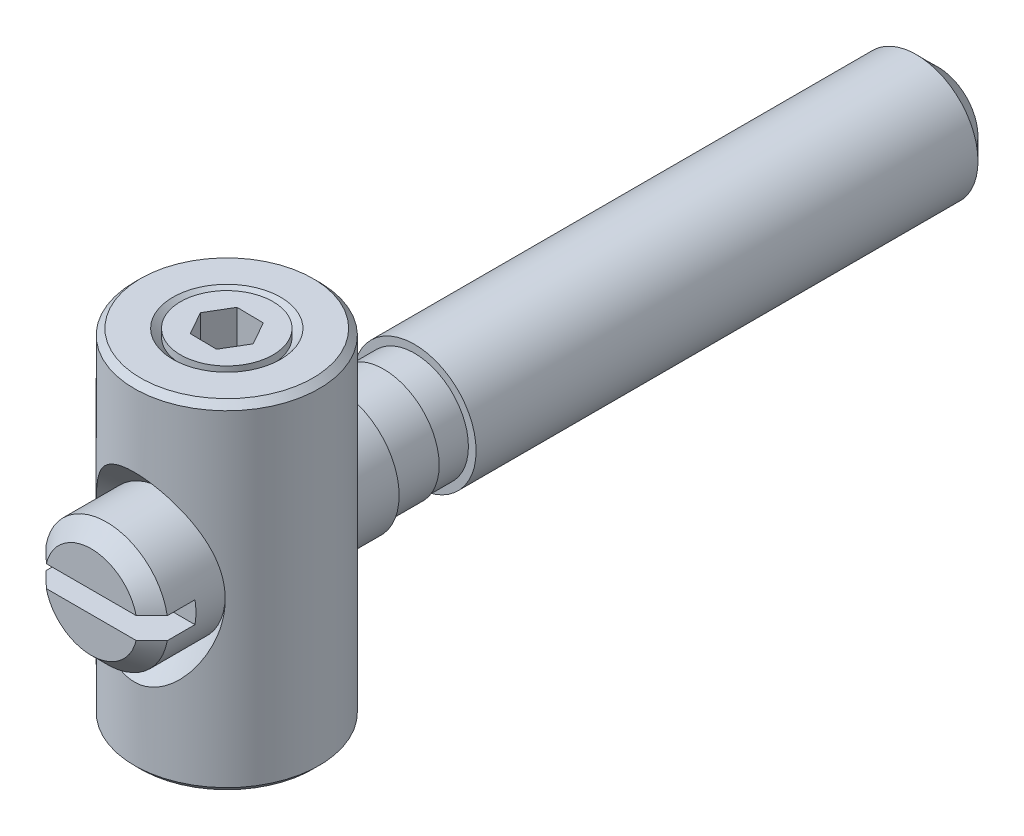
ISO-10303-21;
HEADER;
FILE_DESCRIPTION(('STEP AP214'),'2;1');
FILE_NAME('part.step','',(''),(''),'','','');
FILE_SCHEMA(('AUTOMOTIVE_DESIGN { 1 0 10303 214 1 1 1 1 }'));
ENDSEC;
DATA;
#1=APPLICATION_CONTEXT('core data for automotive mechanical design processes');
#2=APPLICATION_PROTOCOL_DEFINITION('international standard','automotive_design',2000,#1);
#3=PRODUCT_CONTEXT('',#1,'mechanical');
#4=PRODUCT('Part','Part','',(#3));
#5=PRODUCT_RELATED_PRODUCT_CATEGORY('part','',(#4));
#6=PRODUCT_DEFINITION_FORMATION('','',#4);
#7=PRODUCT_DEFINITION_CONTEXT('part definition',#1,'design');
#8=PRODUCT_DEFINITION('design','',#6,#7);
#9=PRODUCT_DEFINITION_SHAPE('','',#8);
#10=(LENGTH_UNIT() NAMED_UNIT(*) SI_UNIT(.MILLI.,.METRE.));
#11=(NAMED_UNIT(*) PLANE_ANGLE_UNIT() SI_UNIT($,.RADIAN.));
#12=(NAMED_UNIT(*) SI_UNIT($,.STERADIAN.) SOLID_ANGLE_UNIT());
#13=UNCERTAINTY_MEASURE_WITH_UNIT(LENGTH_MEASURE(1.E-05),#10,'distance_accuracy_value','');
#14=(GEOMETRIC_REPRESENTATION_CONTEXT(3) GLOBAL_UNCERTAINTY_ASSIGNED_CONTEXT((#13)) GLOBAL_UNIT_ASSIGNED_CONTEXT((#10,
#11,#12)) REPRESENTATION_CONTEXT('',''));
#15=CARTESIAN_POINT('',(0.,0.,0.));
#16=DIRECTION('',(0.,0.,1.));
#17=DIRECTION('',(1.,0.,0.));
#18=AXIS2_PLACEMENT_3D('',#15,#16,#17);
#19=CARTESIAN_POINT('',(0.,0.,34.697365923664));
#20=DIRECTION('',(0.,0.,1.));
#21=DIRECTION('',(1.,0.,0.));
#22=AXIS2_PLACEMENT_3D('',#19,#20,#21);
#23=CYLINDRICAL_SURFACE('',#22,2.);
#24=CARTESIAN_POINT('',(0.,0.,-22.398));
#25=DIRECTION('',(0.,0.,-1.));
#26=DIRECTION('',(0.,-1.,0.));
#27=AXIS2_PLACEMENT_3D('',#24,#25,#26);
#28=CIRCLE('',#27,2.);
#29=CARTESIAN_POINT('',(0.,-2.,-22.398));
#30=VERTEX_POINT('',#29);
#31=EDGE_CURVE('E9',#30,#30,#28,.F.);
#32=ORIENTED_EDGE('',*,*,#31,.T.);
#33=EDGE_LOOP('',(#32));
#34=FACE_BOUND('',#33,.T.);
#35=CARTESIAN_POINT('',(0.,0.,-6.098));
#36=DIRECTION('',(0.,0.,1.));
#37=DIRECTION('',(1.,0.,0.));
#38=AXIS2_PLACEMENT_3D('',#35,#36,#37);
#39=CIRCLE('',#38,2.);
#40=CARTESIAN_POINT('',(2.,0.,-6.098));
#41=VERTEX_POINT('',#40);
#42=EDGE_CURVE('E283',#41,#41,#39,.T.);
#43=ORIENTED_EDGE('',*,*,#42,.F.);
#44=EDGE_LOOP('',(#43));
#45=FACE_BOUND('',#44,.T.);
#46=ADVANCED_FACE('F14',(#34,#45),#23,.T.);
#47=CARTESIAN_POINT('',(0.,0.,4.402));
#48=DIRECTION('',(0.,0.,-1.));
#49=DIRECTION('',(-1.,0.,0.));
#50=AXIS2_PLACEMENT_3D('',#47,#48,#49);
#51=PLANE('',#50);
#52=CARTESIAN_POINT('',(0.,0.,4.402));
#53=DIRECTION('',(0.,0.,-1.));
#54=DIRECTION('',(-1.,0.,0.));
#55=AXIS2_PLACEMENT_3D('',#52,#53,#54);
#56=CIRCLE('',#55,1.5);
#57=CARTESIAN_POINT('',(1.45859521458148,0.35,4.402));
#58=VERTEX_POINT('',#57);
#59=CARTESIAN_POINT('',(-1.45859521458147,0.35,4.402));
#60=VERTEX_POINT('',#59);
#61=EDGE_CURVE('E286',#58,#60,#56,.F.);
#62=ORIENTED_EDGE('',*,*,#61,.T.);
#63=DIRECTION('',(-1.,0.,0.));
#64=VECTOR('',#63,1.);
#65=CARTESIAN_POINT('',(-1.96913686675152,0.35,4.402));
#66=LINE('',#65,#64);
#67=EDGE_CURVE('E31',#58,#60,#66,.T.);
#68=ORIENTED_EDGE('',*,*,#67,.F.);
#69=EDGE_LOOP('',(#62,#68));
#70=FACE_BOUND('',#69,.T.);
#71=ADVANCED_FACE('F205',(#70),#51,.F.);
#72=CARTESIAN_POINT('',(-1.45859521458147,-0.35,4.402));
#73=VERTEX_POINT('',#72);
#74=CARTESIAN_POINT('',(1.45859521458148,-0.35,4.402));
#75=VERTEX_POINT('',#74);
#76=EDGE_CURVE('E292',#73,#75,#56,.F.);
#77=ORIENTED_EDGE('',*,*,#76,.T.);
#78=DIRECTION('',(1.,0.,0.));
#79=VECTOR('',#78,1.);
#80=CARTESIAN_POINT('',(-1.96913686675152,-0.35,4.402));
#81=LINE('',#80,#79);
#82=EDGE_CURVE('E324',#73,#75,#81,.T.);
#83=ORIENTED_EDGE('',*,*,#82,.F.);
#84=EDGE_LOOP('',(#77,#83));
#85=FACE_BOUND('',#84,.T.);
#86=ADVANCED_FACE('F212',(#85),#51,.F.);
#87=CARTESIAN_POINT('',(0.,0.,4.402));
#88=DIRECTION('',(0.,0.,-1.));
#89=DIRECTION('',(-1.,0.,0.));
#90=AXIS2_PLACEMENT_3D('',#87,#88,#89);
#91=CONICAL_SURFACE('',#90,1.5,0.785398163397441);
#92=CARTESIAN_POINT('',(4.35126885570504,0.349999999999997,1.53667748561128));
#93=CARTESIAN_POINT('',(4.19641291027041,0.35,1.69103028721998));
#94=CARTESIAN_POINT('',(4.04153476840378,0.350000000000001,1.84536085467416));
#95=CARTESIAN_POINT('',(3.73169612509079,0.350000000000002,2.15395346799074));
#96=CARTESIAN_POINT('',(3.57673562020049,0.350000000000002,2.30821551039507));
#97=CARTESIAN_POINT('',(3.2665365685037,0.350000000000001,2.616803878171));
#98=CARTESIAN_POINT('',(3.11129790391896,0.350000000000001,2.77113008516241));
#99=CARTESIAN_POINT('',(2.80066386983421,0.350000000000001,3.07961097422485));
#100=CARTESIAN_POINT('',(2.64526850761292,0.350000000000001,3.23376566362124));
#101=CARTESIAN_POINT('',(2.34228144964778,0.350000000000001,3.53380176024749));
#102=CARTESIAN_POINT('',(2.19470355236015,0.350000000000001,3.67969710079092));
#103=CARTESIAN_POINT('',(1.89910586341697,0.350000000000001,3.97107818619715));
#104=CARTESIAN_POINT('',(1.75108601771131,0.350000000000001,4.11656387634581));
#105=CARTESIAN_POINT('',(1.52844687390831,0.350000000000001,4.33406929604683));
#106=CARTESIAN_POINT('',(1.45415744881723,0.350000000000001,4.40642627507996));
#107=CARTESIAN_POINT('',(1.30522725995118,0.350000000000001,4.55078536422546));
#108=CARTESIAN_POINT('',(1.23058647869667,0.350000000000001,4.62278745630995));
#109=CARTESIAN_POINT('',(1.08076094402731,0.350000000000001,4.76619144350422));
#110=CARTESIAN_POINT('',(1.00557632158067,0.350000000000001,4.83759347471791));
#111=CARTESIAN_POINT('',(0.892022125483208,0.350000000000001,4.94386077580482));
#112=CARTESIAN_POINT('',(0.85404275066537,0.350000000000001,4.97914249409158));
#113=CARTESIAN_POINT('',(0.777709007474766,0.35,5.04929736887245));
#114=CARTESIAN_POINT('',(0.739354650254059,0.35,5.08417053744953));
#115=CARTESIAN_POINT('',(0.679196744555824,0.35,5.13798633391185));
#116=CARTESIAN_POINT('',(0.65758598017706,0.350000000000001,5.15714426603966));
#117=CARTESIAN_POINT('',(0.614138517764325,0.350000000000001,5.19520729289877));
#118=CARTESIAN_POINT('',(0.592301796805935,0.350000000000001,5.21411236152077));
#119=CARTESIAN_POINT('',(0.548146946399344,0.350000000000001,5.25174589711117));
#120=CARTESIAN_POINT('',(0.525826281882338,0.350000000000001,5.27047139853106));
#121=CARTESIAN_POINT('',(0.480797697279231,0.35,5.3074405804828));
#122=CARTESIAN_POINT('',(0.458089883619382,0.35,5.3256843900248));
#123=CARTESIAN_POINT('',(0.411906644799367,0.35,5.36167156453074));
#124=CARTESIAN_POINT('',(0.388425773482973,0.35,5.37940798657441));
#125=CARTESIAN_POINT('',(0.340709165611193,0.350000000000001,5.41383103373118));
#126=CARTESIAN_POINT('',(0.316473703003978,0.350000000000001,5.43051803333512));
#127=CARTESIAN_POINT('',(0.267118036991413,0.350000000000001,5.46212071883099));
#128=CARTESIAN_POINT('',(0.242006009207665,0.350000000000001,5.47704896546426));
#129=CARTESIAN_POINT('',(0.19037670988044,0.35,5.50417839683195));
#130=CARTESIAN_POINT('',(0.16386395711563,0.35,5.51638775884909));
#131=CARTESIAN_POINT('',(0.115662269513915,0.35,5.53389096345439));
#132=CARTESIAN_POINT('',(0.0943343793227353,0.35,5.54014013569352));
#133=CARTESIAN_POINT('',(0.0509670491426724,0.35,5.54893856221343));
#134=CARTESIAN_POINT('',(0.0289307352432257,0.35,5.55150226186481));
#135=CARTESIAN_POINT('',(-0.0153473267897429,0.35,5.55236596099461));
#136=CARTESIAN_POINT('',(-0.0375895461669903,0.35,5.55064352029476));
#137=CARTESIAN_POINT('',(-0.0814521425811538,0.35,5.54330655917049));
#138=CARTESIAN_POINT('',(-0.103070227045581,0.35,5.53767922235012));
#139=CARTESIAN_POINT('',(-0.146000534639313,0.35,5.52332975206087));
#140=CARTESIAN_POINT('',(-0.167279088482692,0.35,5.51451156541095));
#141=CARTESIAN_POINT('',(-0.208879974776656,0.350000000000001,5.49482143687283));
#142=CARTESIAN_POINT('',(-0.229200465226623,0.35,5.48394572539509));
#143=CARTESIAN_POINT('',(-0.269207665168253,0.35,5.46074603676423));
#144=CARTESIAN_POINT('',(-0.288887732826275,0.35,5.44841081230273));
#145=CARTESIAN_POINT('',(-0.327605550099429,0.35,5.42281699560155));
#146=CARTESIAN_POINT('',(-0.346643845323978,0.35,5.40955921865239));
#147=CARTESIAN_POINT('',(-0.406445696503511,0.35,5.36638652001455));
#148=CARTESIAN_POINT('',(-0.446338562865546,0.35,5.33527476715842));
#149=CARTESIAN_POINT('',(-0.524892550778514,0.350000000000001,5.27152437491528));
#150=CARTESIAN_POINT('',(-0.563552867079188,0.35,5.23888477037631));
#151=CARTESIAN_POINT('',(-0.640169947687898,0.35,5.17265387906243));
#152=CARTESIAN_POINT('',(-0.678125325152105,0.35,5.1390609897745));
#153=CARTESIAN_POINT('',(-0.753518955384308,0.35,5.07132508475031));
#154=CARTESIAN_POINT('',(-0.790957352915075,0.35,5.03718222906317));
#155=CARTESIAN_POINT('',(-0.902510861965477,0.35,4.93443874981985));
#156=CARTESIAN_POINT('',(-0.976123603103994,0.35,4.8652936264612));
#157=CARTESIAN_POINT('',(-1.12257494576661,0.35,4.72634664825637));
#158=CARTESIAN_POINT('',(-1.19541427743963,0.35,4.65654555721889));
#159=CARTESIAN_POINT('',(-1.39829359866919,0.35,4.46099580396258));
#160=CARTESIAN_POINT('',(-1.52788326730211,0.35,4.33478022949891));
#161=CARTESIAN_POINT('',(-1.78647544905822,0.35,4.08174671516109));
#162=CARTESIAN_POINT('',(-1.91547795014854,0.35,3.95492876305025));
#163=CARTESIAN_POINT('',(-2.17321511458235,0.35,3.70088959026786));
#164=CARTESIAN_POINT('',(-2.30194960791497,0.35,3.57366819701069));
#165=CARTESIAN_POINT('',(-2.55921717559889,0.35,3.31902418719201));
#166=CARTESIAN_POINT('',(-2.68775025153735,0.35,3.19160157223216));
#167=CARTESIAN_POINT('',(-3.07247665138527,0.35,2.80981746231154));
#168=CARTESIAN_POINT('',(-3.32848011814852,0.349999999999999,2.55526465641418));
#169=CARTESIAN_POINT('',(-3.71223239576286,0.35,2.17332351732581));
#170=CARTESIAN_POINT('',(-3.84007220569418,0.35,2.04602651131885));
#171=CARTESIAN_POINT('',(-4.09570351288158,0.349999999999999,1.79138474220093));
#172=CARTESIAN_POINT('',(-4.22349501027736,0.349999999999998,1.66403997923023));
#173=CARTESIAN_POINT('',(-4.35126885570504,0.349999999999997,1.53667748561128));
#174=B_SPLINE_CURVE_WITH_KNOTS('',3,(#92,#93,#94,#95,#96,#97,#98,#99,#100,#101,#102,#103,#104,
#105,#106,#107,#108,#109,#110,#111,#112,#113,#114,#115,#116,#117,#118,#119,#120,#121,#122,#123,
#124,#125,#126,#127,#128,#129,#130,#131,#132,#133,#134,#135,#136,#137,#138,#139,#140,#141,#142,
#143,#144,#145,#146,#147,#148,#149,#150,#151,#152,#153,#154,#155,#156,#157,#158,#159,#160,#161,
#162,#163,#164,#165,#166,#167,#168,#169,#170,#171,#172,#173),.UNSPECIFIED.,.F.,.F.,(4,2,2,2,2,2,
2,2,2,2,2,2,2,2,2,2,2,2,2,2,2,2,2,2,2,2,2,2,2,2,2,2,2,2,2,2,2,2,2,2,4),(0.,0.655931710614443,
1.31189343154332,1.96858248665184,2.62524232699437,3.24780305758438,3.87044333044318,
4.18155345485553,4.49267922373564,4.80373240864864,4.95924629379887,5.1147555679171,
5.20139397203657,5.28804125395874,5.37544205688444,5.46281920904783,5.55108162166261,
5.63931235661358,5.72686889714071,5.81415843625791,5.88059131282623,5.94676308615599,
6.0132820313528,6.08002033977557,6.14896231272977,6.21803183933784,6.28767333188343,
6.3572540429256,6.50893272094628,6.66070854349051,6.81275669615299,6.9647613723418,
7.26773191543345,7.57038509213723,8.11307078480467,8.65576754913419,9.19874089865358,
9.74170994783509,10.8247672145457,11.3659953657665,11.9072219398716),.UNSPECIFIED.);
#175=CARTESIAN_POINT('',(1.96913686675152,0.35,3.902));
#176=VERTEX_POINT('',#175);
#177=EDGE_CURVE('E242',#176,#58,#174,.T.);
#178=ORIENTED_EDGE('',*,*,#177,.F.);
#179=CARTESIAN_POINT('',(0.,0.,3.902));
#180=DIRECTION('',(0.,0.,-1.));
#181=DIRECTION('',(-1.,0.,0.));
#182=AXIS2_PLACEMENT_3D('',#179,#180,#181);
#183=CIRCLE('',#182,2.);
#184=CARTESIAN_POINT('',(-1.96913686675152,0.35,3.902));
#185=VERTEX_POINT('',#184);
#186=EDGE_CURVE('E295',#185,#176,#183,.T.);
#187=ORIENTED_EDGE('',*,*,#186,.F.);
#188=EDGE_CURVE('E229',#60,#185,#174,.T.);
#189=ORIENTED_EDGE('',*,*,#188,.F.);
#190=ORIENTED_EDGE('',*,*,#61,.F.);
#191=EDGE_LOOP('',(#178,#187,#189,#190));
#192=FACE_BOUND('',#191,.T.);
#193=ADVANCED_FACE('F220',(#192),#91,.T.);
#194=CARTESIAN_POINT('',(-1.96913686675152,0.35,3.002));
#195=DIRECTION('',(0.,1.,0.));
#196=DIRECTION('',(-1.,0.,0.));
#197=AXIS2_PLACEMENT_3D('',#194,#195,#196);
#198=PLANE('',#197);
#199=ORIENTED_EDGE('',*,*,#177,.T.);
#200=ORIENTED_EDGE('',*,*,#67,.T.);
#201=ORIENTED_EDGE('',*,*,#188,.T.);
#202=DIRECTION('',(0.,0.,1.));
#203=VECTOR('',#202,1.);
#204=CARTESIAN_POINT('',(-1.96913686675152,0.35,3.002));
#205=LINE('',#204,#203);
#206=CARTESIAN_POINT('',(-1.96913686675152,0.35,3.002));
#207=VERTEX_POINT('',#206);
#208=EDGE_CURVE('E341',#207,#185,#205,.T.);
#209=ORIENTED_EDGE('',*,*,#208,.F.);
#210=DIRECTION('',(-1.,0.,0.));
#211=VECTOR('',#210,1.);
#212=CARTESIAN_POINT('',(-1.96913686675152,0.35,3.002));
#213=LINE('',#212,#211);
#214=CARTESIAN_POINT('',(1.96913686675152,0.35,3.002));
#215=VERTEX_POINT('',#214);
#216=EDGE_CURVE('E332',#215,#207,#213,.T.);
#217=ORIENTED_EDGE('',*,*,#216,.F.);
#218=DIRECTION('',(0.,0.,1.));
#219=VECTOR('',#218,1.);
#220=CARTESIAN_POINT('',(1.96913686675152,0.35,3.002));
#221=LINE('',#220,#219);
#222=EDGE_CURVE('E343',#215,#176,#221,.T.);
#223=ORIENTED_EDGE('',*,*,#222,.T.);
#224=EDGE_LOOP('',(#199,#200,#201,#209,#217,#223));
#225=FACE_BOUND('',#224,.T.);
#226=ADVANCED_FACE('F224',(#225),#198,.F.);
#227=CARTESIAN_POINT('',(0.,0.,3.002));
#228=DIRECTION('',(0.,0.,1.));
#229=DIRECTION('',(1.,0.,0.));
#230=AXIS2_PLACEMENT_3D('',#227,#228,#229);
#231=PLANE('',#230);
#232=CARTESIAN_POINT('',(0.,0.,3.002));
#233=DIRECTION('',(0.,0.,1.));
#234=DIRECTION('',(1.,0.,0.));
#235=AXIS2_PLACEMENT_3D('',#232,#233,#234);
#236=CIRCLE('',#235,2.);
#237=CARTESIAN_POINT('',(1.96913686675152,-0.35,3.002));
#238=VERTEX_POINT('',#237);
#239=EDGE_CURVE('E329',#238,#215,#236,.T.);
#240=ORIENTED_EDGE('',*,*,#239,.T.);
#241=ORIENTED_EDGE('',*,*,#216,.T.);
#242=CARTESIAN_POINT('',(0.,0.,3.002));
#243=DIRECTION('',(0.,0.,1.));
#244=DIRECTION('',(1.,0.,0.));
#245=AXIS2_PLACEMENT_3D('',#242,#243,#244);
#246=CIRCLE('',#245,2.);
#247=CARTESIAN_POINT('',(-1.96913686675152,-0.35,3.002));
#248=VERTEX_POINT('',#247);
#249=EDGE_CURVE('E362',#207,#248,#246,.T.);
#250=ORIENTED_EDGE('',*,*,#249,.T.);
#251=DIRECTION('',(1.,0.,0.));
#252=VECTOR('',#251,1.);
#253=CARTESIAN_POINT('',(-1.96913686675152,-0.35,3.002));
#254=LINE('',#253,#252);
#255=EDGE_CURVE('E346',#248,#238,#254,.T.);
#256=ORIENTED_EDGE('',*,*,#255,.T.);
#257=EDGE_LOOP('',(#240,#241,#250,#256));
#258=FACE_BOUND('',#257,.T.);
#259=ADVANCED_FACE('F247',(#258),#231,.T.);
#260=CARTESIAN_POINT('',(-1.96913686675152,-0.35,3.002));
#261=DIRECTION('',(0.,-1.,0.));
#262=DIRECTION('',(1.,0.,0.));
#263=AXIS2_PLACEMENT_3D('',#260,#261,#262);
#264=PLANE('',#263);
#265=CARTESIAN_POINT('',(-4.35126885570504,-0.35,1.53667748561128));
#266=CARTESIAN_POINT('',(-4.19641291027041,-0.35,1.69103028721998));
#267=CARTESIAN_POINT('',(-4.04153476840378,-0.35,1.84536085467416));
#268=CARTESIAN_POINT('',(-3.73169612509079,-0.35,2.15395346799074));
#269=CARTESIAN_POINT('',(-3.57673562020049,-0.35,2.30821551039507));
#270=CARTESIAN_POINT('',(-3.2665365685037,-0.35,2.61680387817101));
#271=CARTESIAN_POINT('',(-3.11129790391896,-0.35,2.77113008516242));
#272=CARTESIAN_POINT('',(-2.8006638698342,-0.35,3.07961097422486));
#273=CARTESIAN_POINT('',(-2.64526850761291,-0.35,3.23376566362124));
#274=CARTESIAN_POINT('',(-2.34228144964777,-0.35,3.5338017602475));
#275=CARTESIAN_POINT('',(-2.19470355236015,-0.35,3.67969710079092));
#276=CARTESIAN_POINT('',(-1.89910586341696,-0.35,3.97107818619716));
#277=CARTESIAN_POINT('',(-1.7510860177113,-0.35,4.11656387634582));
#278=CARTESIAN_POINT('',(-1.52844687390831,-0.35,4.33406929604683));
#279=CARTESIAN_POINT('',(-1.45415744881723,-0.35,4.40642627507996));
#280=CARTESIAN_POINT('',(-1.30522725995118,-0.35,4.55078536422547));
#281=CARTESIAN_POINT('',(-1.23058647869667,-0.35,4.62278745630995));
#282=CARTESIAN_POINT('',(-1.08076094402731,-0.35,4.76619144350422));
#283=CARTESIAN_POINT('',(-1.00557632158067,-0.35,4.83759347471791));
#284=CARTESIAN_POINT('',(-0.892022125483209,-0.35,4.94386077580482));
#285=CARTESIAN_POINT('',(-0.854042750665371,-0.35,4.97914249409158));
#286=CARTESIAN_POINT('',(-0.777709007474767,-0.35,5.04929736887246));
#287=CARTESIAN_POINT('',(-0.739354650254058,-0.35,5.08417053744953));
#288=CARTESIAN_POINT('',(-0.679196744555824,-0.35,5.13798633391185));
#289=CARTESIAN_POINT('',(-0.657585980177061,-0.35,5.15714426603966));
#290=CARTESIAN_POINT('',(-0.614138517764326,-0.35,5.19520729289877));
#291=CARTESIAN_POINT('',(-0.592301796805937,-0.35,5.21411236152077));
#292=CARTESIAN_POINT('',(-0.548146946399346,-0.35,5.25174589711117));
#293=CARTESIAN_POINT('',(-0.52582628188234,-0.35,5.27047139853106));
#294=CARTESIAN_POINT('',(-0.480797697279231,-0.35,5.30744058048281));
#295=CARTESIAN_POINT('',(-0.458089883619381,-0.35,5.3256843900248));
#296=CARTESIAN_POINT('',(-0.411906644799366,-0.35,5.36167156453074));
#297=CARTESIAN_POINT('',(-0.388425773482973,-0.35,5.37940798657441));
#298=CARTESIAN_POINT('',(-0.340709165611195,-0.35,5.41383103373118));
#299=CARTESIAN_POINT('',(-0.316473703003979,-0.35,5.43051803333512));
#300=CARTESIAN_POINT('',(-0.267118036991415,-0.35,5.46212071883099));
#301=CARTESIAN_POINT('',(-0.242006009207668,-0.35,5.47704896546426));
#302=CARTESIAN_POINT('',(-0.190376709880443,-0.35,5.50417839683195));
#303=CARTESIAN_POINT('',(-0.16386395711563,-0.35,5.51638775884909));
#304=CARTESIAN_POINT('',(-0.115662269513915,-0.35,5.53389096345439));
#305=CARTESIAN_POINT('',(-0.0943343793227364,-0.35,5.54014013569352));
#306=CARTESIAN_POINT('',(-0.0509670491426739,-0.35,5.54893856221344));
#307=CARTESIAN_POINT('',(-0.0289307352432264,-0.35,5.55150226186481));
#308=CARTESIAN_POINT('',(0.0153473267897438,-0.35,5.55236596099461));
#309=CARTESIAN_POINT('',(0.0375895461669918,-0.35,5.55064352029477));
#310=CARTESIAN_POINT('',(0.0814521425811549,-0.35,5.5433065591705));
#311=CARTESIAN_POINT('',(0.103070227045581,-0.35,5.53767922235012));
#312=CARTESIAN_POINT('',(0.146000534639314,-0.35,5.52332975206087));
#313=CARTESIAN_POINT('',(0.167279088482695,-0.35,5.51451156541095));
#314=CARTESIAN_POINT('',(0.20887997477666,-0.35,5.49482143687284));
#315=CARTESIAN_POINT('',(0.229200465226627,-0.35,5.4839457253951));
#316=CARTESIAN_POINT('',(0.269207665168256,-0.35,5.46074603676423));
#317=CARTESIAN_POINT('',(0.288887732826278,-0.35,5.44841081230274));
#318=CARTESIAN_POINT('',(0.327605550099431,-0.35,5.42281699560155));
#319=CARTESIAN_POINT('',(0.346643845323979,-0.35,5.40955921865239));
#320=CARTESIAN_POINT('',(0.406445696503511,-0.35,5.36638652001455));
#321=CARTESIAN_POINT('',(0.446338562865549,-0.35,5.33527476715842));
#322=CARTESIAN_POINT('',(0.524892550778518,-0.35,5.27152437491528));
#323=CARTESIAN_POINT('',(0.563552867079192,-0.35,5.23888477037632));
#324=CARTESIAN_POINT('',(0.640169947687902,-0.35,5.17265387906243));
#325=CARTESIAN_POINT('',(0.678125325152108,-0.35,5.1390609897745));
#326=CARTESIAN_POINT('',(0.753518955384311,-0.35,5.07132508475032));
#327=CARTESIAN_POINT('',(0.790957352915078,-0.35,5.03718222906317));
#328=CARTESIAN_POINT('',(0.902510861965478,-0.35,4.93443874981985));
#329=CARTESIAN_POINT('',(0.976123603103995,-0.35,4.86529362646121));
#330=CARTESIAN_POINT('',(1.12257494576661,-0.35,4.72634664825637));
#331=CARTESIAN_POINT('',(1.19541427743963,-0.35,4.65654555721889));
#332=CARTESIAN_POINT('',(1.39829359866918,-0.35,4.46099580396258));
#333=CARTESIAN_POINT('',(1.52788326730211,-0.35,4.33478022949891));
#334=CARTESIAN_POINT('',(1.78647544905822,-0.35,4.08174671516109));
#335=CARTESIAN_POINT('',(1.91547795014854,-0.35,3.95492876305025));
#336=CARTESIAN_POINT('',(2.17321511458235,-0.35,3.70088959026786));
#337=CARTESIAN_POINT('',(2.30194960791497,-0.35,3.57366819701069));
#338=CARTESIAN_POINT('',(2.55921717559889,-0.35,3.31902418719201));
#339=CARTESIAN_POINT('',(2.68775025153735,-0.35,3.19160157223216));
#340=CARTESIAN_POINT('',(3.07247665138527,-0.35,2.80981746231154));
#341=CARTESIAN_POINT('',(3.32848011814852,-0.35,2.55526465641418));
#342=CARTESIAN_POINT('',(3.71223239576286,-0.35,2.17332351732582));
#343=CARTESIAN_POINT('',(3.84007220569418,-0.35,2.04602651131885));
#344=CARTESIAN_POINT('',(4.09570351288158,-0.35,1.79138474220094));
#345=CARTESIAN_POINT('',(4.22349501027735,-0.35,1.66403997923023));
#346=CARTESIAN_POINT('',(4.35126885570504,-0.35,1.53667748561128));
#347=B_SPLINE_CURVE_WITH_KNOTS('',3,(#265,#266,#267,#268,#269,#270,#271,#272,#273,#274,#275,
#276,#277,#278,#279,#280,#281,#282,#283,#284,#285,#286,#287,#288,#289,#290,#291,#292,#293,#294,
#295,#296,#297,#298,#299,#300,#301,#302,#303,#304,#305,#306,#307,#308,#309,#310,#311,#312,#313,
#314,#315,#316,#317,#318,#319,#320,#321,#322,#323,#324,#325,#326,#327,#328,#329,#330,#331,#332,
#333,#334,#335,#336,#337,#338,#339,#340,#341,#342,#343,#344,#345,#346),.UNSPECIFIED.,.F.,.F.,(4,
2,2,2,2,2,2,2,2,2,2,2,2,2,2,2,2,2,2,2,2,2,2,2,2,2,2,2,2,2,2,2,2,2,2,2,2,2,2,2,4),(0.,
0.655931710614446,1.31189343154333,1.96858248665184,2.62524232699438,3.24780305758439,
3.87044333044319,4.18155345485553,4.49267922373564,4.80373240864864,4.95924629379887,
5.1147555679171,5.20139397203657,5.28804125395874,5.37544205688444,5.46281920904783,
5.55108162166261,5.63931235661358,5.72686889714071,5.81415843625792,5.88059131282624,
5.94676308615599,6.0132820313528,6.08002033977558,6.14896231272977,6.21803183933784,
6.28767333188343,6.35725404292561,6.50893272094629,6.66070854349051,6.812756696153,
6.96476137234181,7.26773191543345,7.57038509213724,8.11307078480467,8.65576754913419,
9.19874089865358,9.7417099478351,10.8247672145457,11.3659953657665,11.9072219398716),.UNSPECIFIED.);
#348=CARTESIAN_POINT('',(-1.96913686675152,-0.35,3.902));
#349=VERTEX_POINT('',#348);
#350=EDGE_CURVE('E134',#349,#73,#347,.T.);
#351=ORIENTED_EDGE('',*,*,#350,.T.);
#352=ORIENTED_EDGE('',*,*,#82,.T.);
#353=CARTESIAN_POINT('',(1.96913686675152,-0.35,3.902));
#354=VERTEX_POINT('',#353);
#355=EDGE_CURVE('E236',#75,#354,#347,.T.);
#356=ORIENTED_EDGE('',*,*,#355,.T.);
#357=DIRECTION('',(0.,0.,1.));
#358=VECTOR('',#357,1.);
#359=CARTESIAN_POINT('',(1.96913686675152,-0.35,3.002));
#360=LINE('',#359,#358);
#361=EDGE_CURVE('E313',#238,#354,#360,.T.);
#362=ORIENTED_EDGE('',*,*,#361,.F.);
#363=ORIENTED_EDGE('',*,*,#255,.F.);
#364=DIRECTION('',(0.,0.,1.));
#365=VECTOR('',#364,1.);
#366=CARTESIAN_POINT('',(-1.96913686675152,-0.35,3.002));
#367=LINE('',#366,#365);
#368=EDGE_CURVE('E310',#248,#349,#367,.T.);
#369=ORIENTED_EDGE('',*,*,#368,.T.);
#370=EDGE_LOOP('',(#351,#352,#356,#362,#363,#369));
#371=FACE_BOUND('',#370,.T.);
#372=ADVANCED_FACE('F243',(#371),#264,.F.);
#373=ORIENTED_EDGE('',*,*,#350,.F.);
#374=EDGE_CURVE('E294',#354,#349,#183,.T.);
#375=ORIENTED_EDGE('',*,*,#374,.F.);
#376=ORIENTED_EDGE('',*,*,#355,.F.);
#377=ORIENTED_EDGE('',*,*,#76,.F.);
#378=EDGE_LOOP('',(#373,#375,#376,#377));
#379=FACE_BOUND('',#378,.T.);
#380=ADVANCED_FACE('F226',(#379),#91,.T.);
#381=CARTESIAN_POINT('',(0.,0.,34.697365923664));
#382=DIRECTION('',(0.,0.,1.));
#383=DIRECTION('',(1.,0.,0.));
#384=AXIS2_PLACEMENT_3D('',#381,#382,#383);
#385=CYLINDRICAL_SURFACE('',#384,2.);
#386=ORIENTED_EDGE('',*,*,#374,.T.);
#387=ORIENTED_EDGE('',*,*,#368,.F.);
#388=ORIENTED_EDGE('',*,*,#249,.F.);
#389=ORIENTED_EDGE('',*,*,#208,.T.);
#390=ORIENTED_EDGE('',*,*,#186,.T.);
#391=ORIENTED_EDGE('',*,*,#222,.F.);
#392=ORIENTED_EDGE('',*,*,#239,.F.);
#393=ORIENTED_EDGE('',*,*,#361,.T.);
#394=EDGE_LOOP('',(#386,#387,#388,#389,#390,#391,#392,#393));
#395=FACE_BOUND('',#394,.T.);
#396=CARTESIAN_POINT('',(0.,0.,2.05));
#397=DIRECTION('',(0.,0.,1.));
#398=DIRECTION('',(1.,0.,0.));
#399=AXIS2_PLACEMENT_3D('',#396,#397,#398);
#400=CIRCLE('',#399,2.);
#401=CARTESIAN_POINT('',(2.,0.,2.05));
#402=VERTEX_POINT('',#401);
#403=EDGE_CURVE('E129',#402,#402,#400,.F.);
#404=ORIENTED_EDGE('',*,*,#403,.F.);
#405=EDGE_LOOP('',(#404));
#406=FACE_BOUND('',#405,.T.);
#407=ADVANCED_FACE('F256',(#395,#406),#385,.T.);
#408=CARTESIAN_POINT('',(0.,0.,-3.598));
#409=DIRECTION('',(0.,0.,1.));
#410=DIRECTION('',(1.,0.,0.));
#411=AXIS2_PLACEMENT_3D('',#408,#409,#410);
#412=CIRCLE('',#411,2.);
#413=CARTESIAN_POINT('',(2.,0.,-3.598));
#414=VERTEX_POINT('',#413);
#415=EDGE_CURVE('E339',#414,#414,#412,.T.);
#416=ORIENTED_EDGE('',*,*,#415,.T.);
#417=EDGE_LOOP('',(#416));
#418=FACE_BOUND('',#417,.T.);
#419=CARTESIAN_POINT('',(0.,0.,-2.05));
#420=DIRECTION('',(0.,0.,-1.));
#421=DIRECTION('',(-1.,0.,0.));
#422=AXIS2_PLACEMENT_3D('',#419,#420,#421);
#423=CIRCLE('',#422,2.);
#424=CARTESIAN_POINT('',(-2.,0.,-2.05));
#425=VERTEX_POINT('',#424);
#426=EDGE_CURVE('E125',#425,#425,#423,.F.);
#427=ORIENTED_EDGE('',*,*,#426,.F.);
#428=EDGE_LOOP('',(#427));
#429=FACE_BOUND('',#428,.T.);
#430=ADVANCED_FACE('F253',(#418,#429),#385,.T.);
#431=CARTESIAN_POINT('',(0.,1.75,-6.098));
#432=DIRECTION('',(0.,0.,-1.));
#433=DIRECTION('',(-1.,0.,0.));
#434=AXIS2_PLACEMENT_3D('',#431,#432,#433);
#435=PLANE('',#434);
#436=CARTESIAN_POINT('',(0.,0.,-6.098));
#437=DIRECTION('',(0.,0.,1.));
#438=DIRECTION('',(1.,0.,0.));
#439=AXIS2_PLACEMENT_3D('',#436,#437,#438);
#440=CIRCLE('',#439,1.75);
#441=CARTESIAN_POINT('',(1.75,0.,-6.098));
#442=VERTEX_POINT('',#441);
#443=EDGE_CURVE('E282',#442,#442,#440,.T.);
#444=ORIENTED_EDGE('',*,*,#443,.F.);
#445=EDGE_LOOP('',(#444));
#446=FACE_BOUND('',#445,.T.);
#447=ORIENTED_EDGE('',*,*,#42,.T.);
#448=EDGE_LOOP('',(#447));
#449=FACE_BOUND('',#448,.T.);
#450=ADVANCED_FACE('F218',(#446,#449),#435,.F.);
#451=CARTESIAN_POINT('',(0.,0.,34.697365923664));
#452=DIRECTION('',(0.,0.,1.));
#453=DIRECTION('',(1.,0.,0.));
#454=AXIS2_PLACEMENT_3D('',#451,#452,#453);
#455=CYLINDRICAL_SURFACE('',#454,1.75);
#456=CARTESIAN_POINT('',(0.,0.,-5.098));
#457=DIRECTION('',(0.,0.,1.));
#458=DIRECTION('',(1.,0.,0.));
#459=AXIS2_PLACEMENT_3D('',#456,#457,#458);
#460=CIRCLE('',#459,1.75);
#461=CARTESIAN_POINT('',(1.75,0.,-5.098));
#462=VERTEX_POINT('',#461);
#463=EDGE_CURVE('E279',#462,#462,#460,.T.);
#464=ORIENTED_EDGE('',*,*,#463,.F.);
#465=EDGE_LOOP('',(#464));
#466=FACE_BOUND('',#465,.T.);
#467=ORIENTED_EDGE('',*,*,#443,.T.);
#468=EDGE_LOOP('',(#467));
#469=FACE_BOUND('',#468,.T.);
#470=ADVANCED_FACE('F267',(#466,#469),#455,.T.);
#471=CARTESIAN_POINT('',(0.,1.75,-5.098));
#472=DIRECTION('',(0.,0.,1.));
#473=DIRECTION('',(1.,0.,0.));
#474=AXIS2_PLACEMENT_3D('',#471,#472,#473);
#475=PLANE('',#474);
#476=CARTESIAN_POINT('',(0.,0.,-5.098));
#477=DIRECTION('',(0.,0.,1.));
#478=DIRECTION('',(1.,0.,0.));
#479=AXIS2_PLACEMENT_3D('',#476,#477,#478);
#480=CIRCLE('',#479,1.8);
#481=CARTESIAN_POINT('',(1.8,0.,-5.098));
#482=VERTEX_POINT('',#481);
#483=EDGE_CURVE('E288',#482,#482,#480,.T.);
#484=ORIENTED_EDGE('',*,*,#483,.F.);
#485=EDGE_LOOP('',(#484));
#486=FACE_BOUND('',#485,.T.);
#487=ORIENTED_EDGE('',*,*,#463,.T.);
#488=EDGE_LOOP('',(#487));
#489=FACE_BOUND('',#488,.T.);
#490=ADVANCED_FACE('F264',(#486,#489),#475,.F.);
#491=CARTESIAN_POINT('',(0.,0.,34.697365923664));
#492=DIRECTION('',(0.,0.,1.));
#493=DIRECTION('',(1.,0.,0.));
#494=AXIS2_PLACEMENT_3D('',#491,#492,#493);
#495=CYLINDRICAL_SURFACE('',#494,1.8);
#496=CARTESIAN_POINT('',(0.,0.,-3.598));
#497=DIRECTION('',(0.,0.,1.));
#498=DIRECTION('',(1.,0.,0.));
#499=AXIS2_PLACEMENT_3D('',#496,#497,#498);
#500=CIRCLE('',#499,1.8);
#501=CARTESIAN_POINT('',(1.8,0.,-3.598));
#502=VERTEX_POINT('',#501);
#503=EDGE_CURVE('E349',#502,#502,#500,.T.);
#504=ORIENTED_EDGE('',*,*,#503,.F.);
#505=EDGE_LOOP('',(#504));
#506=FACE_BOUND('',#505,.T.);
#507=ORIENTED_EDGE('',*,*,#483,.T.);
#508=EDGE_LOOP('',(#507));
#509=FACE_BOUND('',#508,.T.);
#510=ADVANCED_FACE('F260',(#506,#509),#495,.T.);
#511=CARTESIAN_POINT('',(0.,1.8,-3.598));
#512=DIRECTION('',(0.,0.,1.));
#513=DIRECTION('',(1.,0.,0.));
#514=AXIS2_PLACEMENT_3D('',#511,#512,#513);
#515=PLANE('',#514);
#516=ORIENTED_EDGE('',*,*,#415,.F.);
#517=EDGE_LOOP('',(#516));
#518=FACE_BOUND('',#517,.T.);
#519=ORIENTED_EDGE('',*,*,#503,.T.);
#520=EDGE_LOOP('',(#519));
#521=FACE_BOUND('',#520,.T.);
#522=ADVANCED_FACE('F177',(#518,#521),#515,.F.);
#523=CARTESIAN_POINT('',(0.,0.,-3.));
#524=DIRECTION('',(0.,0.,-1.));
#525=DIRECTION('',(0.,-1.,0.));
#526=AXIS2_PLACEMENT_3D('',#523,#524,#525);
#527=CONICAL_SURFACE('',#526,2.95,0.785398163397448);
#528=CARTESIAN_POINT('',(1.55574486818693,1.97618484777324,-2.56508516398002));
#529=CARTESIAN_POINT('',(1.49200000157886,2.07557437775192,-2.60374741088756));
#530=CARTESIAN_POINT('',(1.42218409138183,2.1709053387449,-2.64286056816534));
#531=CARTESIAN_POINT('',(1.26934325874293,2.3511378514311,-2.71957176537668));
#532=CARTESIAN_POINT('',(1.18632803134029,2.43604697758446,-2.75717089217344));
#533=CARTESIAN_POINT('',(1.02594664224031,2.57467109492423,-2.82013065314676));
#534=CARTESIAN_POINT('',(0.951327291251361,2.63114479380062,-2.84636788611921));
#535=CARTESIAN_POINT('',(0.793469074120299,2.7329236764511,-2.89433640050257));
#536=CARTESIAN_POINT('',(0.710241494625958,2.7782432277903,-2.91607347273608));
#537=CARTESIAN_POINT('',(0.550647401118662,2.84826344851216,-2.94996282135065));
#538=CARTESIAN_POINT('',(0.475459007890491,2.87514428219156,-2.96310984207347));
#539=CARTESIAN_POINT('',(0.321126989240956,2.91722348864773,-2.98377596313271));
#540=CARTESIAN_POINT('',(0.241986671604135,2.93243146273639,-2.99129968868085));
#541=CARTESIAN_POINT('',(0.0815590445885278,2.94994751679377,-2.99997048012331));
#542=CARTESIAN_POINT('',(0.000263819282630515,2.9521985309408,-3.00108933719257));
#543=CARTESIAN_POINT('',(-0.161429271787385,2.943434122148,-2.99674574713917));
#544=CARTESIAN_POINT('',(-0.24182697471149,2.93241633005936,-2.99128212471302));
#545=CARTESIAN_POINT('',(-0.394039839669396,2.89923486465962,-2.97493095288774));
#546=CARTESIAN_POINT('',(-0.466071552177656,2.87785284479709,-2.96442422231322));
#547=CARTESIAN_POINT('',(-0.605828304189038,2.82577461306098,-2.93905193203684));
#548=CARTESIAN_POINT('',(-0.673551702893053,2.79507487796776,-2.9241847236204));
#549=CARTESIAN_POINT('',(-0.836074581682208,2.70883188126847,-2.88289064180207));
#550=CARTESIAN_POINT('',(-0.927800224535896,2.64849715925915,-2.85437537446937));
#551=CARTESIAN_POINT('',(-1.09954127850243,2.51486905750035,-2.79273775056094));
#552=CARTESIAN_POINT('',(-1.17952498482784,2.44154173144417,-2.75960337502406));
#553=CARTESIAN_POINT('',(-1.3625587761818,2.24911914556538,-2.6753985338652));
#554=CARTESIAN_POINT('',(-1.4592314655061,2.12451397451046,-2.62310446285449));
#555=CARTESIAN_POINT('',(-1.63098128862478,1.86077995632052,-2.5199087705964));
#556=CARTESIAN_POINT('',(-1.70602380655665,1.72162830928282,-2.46900949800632));
#557=CARTESIAN_POINT('',(-1.83864617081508,1.42677893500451,-2.37199476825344));
#558=CARTESIAN_POINT('',(-1.89546377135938,1.2706559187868,-2.32613097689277));
#559=CARTESIAN_POINT('',(-1.98829915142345,0.94927260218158,-2.2473125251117));
#560=CARTESIAN_POINT('',(-2.02434028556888,0.784022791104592,-2.2143433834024));
#561=CARTESIAN_POINT('',(-2.06404822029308,0.522769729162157,-2.17716697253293));
#562=CARTESIAN_POINT('',(-2.07498463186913,0.428696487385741,-2.16668954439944));
#563=CARTESIAN_POINT('',(-2.09033557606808,0.239509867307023,-2.1518874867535));
#564=CARTESIAN_POINT('',(-2.09474995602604,0.144396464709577,-2.14756300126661));
#565=CARTESIAN_POINT('',(-2.09701113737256,-0.0459362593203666,-2.14535429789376));
#566=CARTESIAN_POINT('',(-2.09486091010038,-0.141155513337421,-2.14746716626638));
#567=CARTESIAN_POINT('',(-2.08402094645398,-0.330863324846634,-2.15798826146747));
#568=CARTESIAN_POINT('',(-2.0753314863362,-0.425351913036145,-2.16639622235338));
#569=CARTESIAN_POINT('',(-2.052826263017,-0.602227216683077,-2.18771882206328));
#570=CARTESIAN_POINT('',(-2.03969878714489,-0.684777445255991,-2.20001859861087));
#571=CARTESIAN_POINT('',(-2.00839905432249,-0.8482191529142,-2.22862722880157));
#572=CARTESIAN_POINT('',(-1.99022471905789,-0.929109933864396,-2.24493773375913));
#573=CARTESIAN_POINT('',(-1.92809425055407,-1.16899902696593,-2.29902073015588));
#574=CARTESIAN_POINT('',(-1.87655804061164,-1.32499765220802,-2.34191580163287));
#575=CARTESIAN_POINT('',(-1.78055846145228,-1.55869205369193,-2.41483888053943));
#576=CARTESIAN_POINT('',(-1.74318423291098,-1.64029239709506,-2.44207814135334));
#577=CARTESIAN_POINT('',(-1.66188767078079,-1.79961058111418,-2.498112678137));
#578=CARTESIAN_POINT('',(-1.61796328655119,-1.8773271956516,-2.52690843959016));
#579=CARTESIAN_POINT('',(-1.47608783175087,-2.10332867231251,-2.6140980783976));
#580=CARTESIAN_POINT('',(-1.36775810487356,-2.24516080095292,-2.67352355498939));
#581=CARTESIAN_POINT('',(-1.17516373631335,-2.44519042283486,-2.76128883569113));
#582=CARTESIAN_POINT('',(-1.10140298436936,-2.5126589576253,-2.7917658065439));
#583=CARTESIAN_POINT('',(-0.943845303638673,-2.63668940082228,-2.84888659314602));
#584=CARTESIAN_POINT('',(-0.86006368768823,-2.6932676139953,-2.87553612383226));
#585=CARTESIAN_POINT('',(-0.698871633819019,-2.78315905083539,-2.91842619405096));
#586=CARTESIAN_POINT('',(-0.623058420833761,-2.81883033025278,-2.93567787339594));
#587=CARTESIAN_POINT('',(-0.465902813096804,-2.87838445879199,-2.96467495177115));
#588=CARTESIAN_POINT('',(-0.384564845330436,-2.90227662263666,-2.9764247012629));
#589=CARTESIAN_POINT('',(-0.217694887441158,-2.93644134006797,-2.99327239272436));
#590=CARTESIAN_POINT('',(-0.132136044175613,-2.94661052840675,-2.99831984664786));
#591=CARTESIAN_POINT('',(0.0395564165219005,-2.95194869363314,-3.00096586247));
#592=CARTESIAN_POINT('',(0.125689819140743,-2.94712299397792,-2.99856706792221));
#593=CARTESIAN_POINT('',(0.285285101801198,-2.92443629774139,-2.98734927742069));
#594=CARTESIAN_POINT('',(0.359042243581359,-2.90818187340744,-2.97932186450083));
#595=CARTESIAN_POINT('',(0.502847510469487,-2.86561562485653,-2.95845095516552));
#596=CARTESIAN_POINT('',(0.572894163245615,-2.83929984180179,-2.94560556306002));
#597=CARTESIAN_POINT('',(0.734590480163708,-2.76617263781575,-2.91026416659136));
#598=CARTESIAN_POINT('',(0.824035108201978,-2.71537054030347,-2.88595794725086));
#599=CARTESIAN_POINT('',(0.992766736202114,-2.60109423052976,-2.83236621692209));
#600=CARTESIAN_POINT('',(1.07202948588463,-2.53759065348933,-2.80306919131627));
#601=CARTESIAN_POINT('',(1.25430967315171,-2.36989417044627,-2.72770765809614));
#602=CARTESIAN_POINT('',(1.35172004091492,-2.26033659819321,-2.68008040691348));
#603=CARTESIAN_POINT('',(1.52713535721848,-2.02703275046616,-2.5841566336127));
#604=CARTESIAN_POINT('',(1.60510930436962,-1.9032642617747,-2.53585917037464));
#605=CARTESIAN_POINT('',(1.74629197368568,-1.63946257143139,-2.44089885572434));
#606=CARTESIAN_POINT('',(1.8087250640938,-1.4989597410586,-2.3943946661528));
#607=CARTESIAN_POINT('',(1.91535528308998,-1.20872828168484,-2.30998898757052));
#608=CARTESIAN_POINT('',(1.95955718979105,-1.05900208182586,-2.27208524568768));
#609=CARTESIAN_POINT('',(2.01597470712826,-0.813312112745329,-2.22185602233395));
#610=CARTESIAN_POINT('',(2.03392795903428,-0.719480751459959,-2.20534156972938));
#611=CARTESIAN_POINT('',(2.06316238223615,-0.529930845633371,-2.1780190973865));
#612=CARTESIAN_POINT('',(2.0744431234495,-0.434212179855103,-2.16721144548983));
#613=CARTESIAN_POINT('',(2.09024081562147,-0.241788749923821,-2.15197918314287));
#614=CARTESIAN_POINT('',(2.0947632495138,-0.14508484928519,-2.14754939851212));
#615=CARTESIAN_POINT('',(2.09701956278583,0.0484695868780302,-2.14534669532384));
#616=CARTESIAN_POINT('',(2.09475434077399,0.145320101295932,-2.14757289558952));
#617=CARTESIAN_POINT('',(2.0840916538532,0.327449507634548,-2.15791751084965));
#618=CARTESIAN_POINT('',(2.07640856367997,0.412810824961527,-2.16534889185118));
#619=CARTESIAN_POINT('',(2.05575742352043,0.582350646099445,-2.18496193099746));
#620=CARTESIAN_POINT('',(2.04278728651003,0.666528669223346,-2.19714546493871));
#621=CARTESIAN_POINT('',(1.99601390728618,0.916557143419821,-2.24003507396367));
#622=CARTESIAN_POINT('',(1.95434493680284,1.07994888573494,-2.27708331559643));
#623=CARTESIAN_POINT('',(1.85917846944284,1.36924039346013,-2.35510701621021));
#624=CARTESIAN_POINT('',(1.80896198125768,1.49674511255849,-2.39430218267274));
#625=CARTESIAN_POINT('',(1.69372386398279,1.74333055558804,-2.47716493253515));
#626=CARTESIAN_POINT('',(1.62871171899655,1.86241661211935,-2.52082964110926));
#627=CARTESIAN_POINT('',(1.55574486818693,1.97618484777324,-2.56508516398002));
#628=B_SPLINE_CURVE_WITH_KNOTS('',3,(#528,#529,#530,#531,#532,#533,#534,#535,#536,#537,#538,
#539,#540,#541,#542,#543,#544,#545,#546,#547,#548,#549,#550,#551,#552,#553,#554,#555,#556,#557,
#558,#559,#560,#561,#562,#563,#564,#565,#566,#567,#568,#569,#570,#571,#572,#573,#574,#575,#576,
#577,#578,#579,#580,#581,#582,#583,#584,#585,#586,#587,#588,#589,#590,#591,#592,#593,#594,#595,
#596,#597,#598,#599,#600,#601,#602,#603,#604,#605,#606,#607,#608,#609,#610,#611,#612,#613,#614,
#615,#616,#617,#618,#619,#620,#621,#622,#623,#624,#625,#626,#627),.UNSPECIFIED.,.T.,.F.,(4,2,2,
2,2,2,2,2,2,2,2,2,2,2,2,2,2,2,2,2,2,2,2,2,2,2,2,2,2,2,2,2,2,2,2,2,2,2,2,2,2,2,2,2,2,2,2,2,2,4),
(0.,0.3724838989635,0.744695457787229,1.03536284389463,1.32565384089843,1.56742765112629,
1.80900238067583,2.05164025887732,2.29432146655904,2.52102362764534,2.7478116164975,
3.08619002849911,3.42546593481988,3.92123355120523,4.41779021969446,4.93300790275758,
5.44764529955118,5.73312937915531,6.01862014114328,6.3039817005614,6.58933120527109,
6.8425143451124,7.09580190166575,7.60303055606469,7.88413630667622,8.16533024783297,
8.72539563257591,9.03809242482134,9.35031734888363,9.60595613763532,9.86139244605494,
10.1187422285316,10.3760006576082,10.6028805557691,10.8298498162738,11.145172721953,
11.4612332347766,11.9211410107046,12.381777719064,12.8621478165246,13.3423919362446,
13.6328835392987,13.923393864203,14.2136683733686,14.5039044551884,14.7616713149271,
15.0195400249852,15.5351378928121,15.961781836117,16.3881530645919),.UNSPECIFIED.);
#629=CARTESIAN_POINT('',(1.55574486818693,1.97618484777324,-2.56508516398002));
#630=VERTEX_POINT('',#629);
#631=EDGE_CURVE('E154',#630,#630,#628,.T.);
#632=ORIENTED_EDGE('',*,*,#631,.F.);
#633=EDGE_LOOP('',(#632));
#634=FACE_BOUND('',#633,.T.);
#635=ORIENTED_EDGE('',*,*,#426,.T.);
#636=EDGE_LOOP('',(#635));
#637=FACE_BOUND('',#636,.T.);
#638=ADVANCED_FACE('F172',(#634,#637),#527,.F.);
#639=CARTESIAN_POINT('',(0.,0.,1.8));
#640=DIRECTION('',(0.,0.,1.));
#641=DIRECTION('',(0.,1.,0.));
#642=AXIS2_PLACEMENT_3D('',#639,#640,#641);
#643=CONICAL_SURFACE('',#642,1.75,0.785398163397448);
#644=CARTESIAN_POINT('',(1.55574486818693,1.97618484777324,2.56508516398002));
#645=CARTESIAN_POINT('',(1.65318115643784,1.82428533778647,2.50599487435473));
#646=CARTESIAN_POINT('',(1.73654776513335,1.66276321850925,2.44789715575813));
#647=CARTESIAN_POINT('',(1.84210108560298,1.41016487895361,2.36824677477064));
#648=CARTESIAN_POINT('',(1.87406974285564,1.32410768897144,2.34291327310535));
#649=CARTESIAN_POINT('',(1.9316127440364,1.1489143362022,2.29570514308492));
#650=CARTESIAN_POINT('',(1.95718731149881,1.05977828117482,2.27383039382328));
#651=CARTESIAN_POINT('',(2.00219314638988,0.878000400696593,2.23430741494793));
#652=CARTESIAN_POINT('',(2.02155622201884,0.785331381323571,2.21670658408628));
#653=CARTESIAN_POINT('',(2.05370906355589,0.59803187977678,2.18695244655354));
#654=CARTESIAN_POINT('',(2.06650204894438,0.503402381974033,2.17479647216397));
#655=CARTESIAN_POINT('',(2.08542761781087,0.313096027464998,2.15665594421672));
#656=CARTESIAN_POINT('',(2.09157470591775,0.217421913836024,2.15065795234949));
#657=CARTESIAN_POINT('',(2.09720361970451,0.0256968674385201,2.14516980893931));
#658=CARTESIAN_POINT('',(2.09668618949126,-0.0703540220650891,2.14567893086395));
#659=CARTESIAN_POINT('',(2.08937153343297,-0.252499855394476,2.1528000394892));
#660=CARTESIAN_POINT('',(2.08319716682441,-0.33864456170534,2.15880665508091));
#661=CARTESIAN_POINT('',(2.06548092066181,-0.509899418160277,2.17576023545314));
#662=CARTESIAN_POINT('',(2.05393709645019,-0.595009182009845,2.1867089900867));
#663=CARTESIAN_POINT('',(2.01128724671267,-0.848196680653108,2.22626863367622));
#664=CARTESIAN_POINT('',(1.97216958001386,-1.01396663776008,2.2615848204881));
#665=CARTESIAN_POINT('',(1.87146142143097,-1.34009082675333,2.34563799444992));
#666=CARTESIAN_POINT('',(1.80927795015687,-1.50016749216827,2.39471992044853));
#667=CARTESIAN_POINT('',(1.66163314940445,-1.80690384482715,2.49943742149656));
#668=CARTESIAN_POINT('',(1.57619558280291,-1.95357702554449,2.55506627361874));
#669=CARTESIAN_POINT('',(1.40868164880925,-2.18808550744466,2.64989511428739));
#670=CARTESIAN_POINT('',(1.33304058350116,-2.28051866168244,2.68910342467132));
#671=CARTESIAN_POINT('',(1.16789505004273,-2.45338635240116,2.76482369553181));
#672=CARTESIAN_POINT('',(1.0784141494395,-2.53384083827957,2.80134008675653));
#673=CARTESIAN_POINT('',(0.909510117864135,-2.65996567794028,2.85982894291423));
#674=CARTESIAN_POINT('',(0.833293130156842,-2.70928267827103,2.88314104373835));
#675=CARTESIAN_POINT('',(0.673120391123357,-2.7961576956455,2.92467424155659));
#676=CARTESIAN_POINT('',(0.589175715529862,-2.8337322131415,2.94290247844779));
#677=CARTESIAN_POINT('',(0.429342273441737,-2.88929938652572,2.97003526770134));
#678=CARTESIAN_POINT('',(0.354404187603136,-2.90949807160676,2.97998103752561));
#679=CARTESIAN_POINT('',(0.201799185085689,-2.93827439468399,2.99418315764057));
#680=CARTESIAN_POINT('',(0.124134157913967,-2.94685992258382,2.99844337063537));
#681=CARTESIAN_POINT('',(-0.0318383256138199,-2.95170812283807,3.00084671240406));
#682=CARTESIAN_POINT('',(-0.110146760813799,-2.9479459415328,2.99897750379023));
#683=CARTESIAN_POINT('',(-0.264862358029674,-2.9283694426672,2.98929170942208));
#684=CARTESIAN_POINT('',(-0.341268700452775,-2.91255001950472,2.98147260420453));
#685=CARTESIAN_POINT('',(-0.488745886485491,-2.87050218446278,2.96083986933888));
#686=CARTESIAN_POINT('',(-0.55989176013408,-2.84448295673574,2.9481266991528));
#687=CARTESIAN_POINT('',(-0.697351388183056,-2.78360014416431,2.9186730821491));
#688=CARTESIAN_POINT('',(-0.763663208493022,-2.74873304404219,2.90193103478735));
#689=CARTESIAN_POINT('',(-0.927578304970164,-2.64952653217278,2.85490426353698));
#690=CARTESIAN_POINT('',(-1.02125933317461,-2.57976622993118,2.82236663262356));
#691=CARTESIAN_POINT('',(-1.19539603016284,-2.4270066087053,2.75315479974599));
#692=CARTESIAN_POINT('',(-1.27581248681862,-2.34396941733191,2.71646885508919));
#693=CARTESIAN_POINT('',(-1.45765974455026,-2.12837028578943,2.62483577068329));
#694=CARTESIAN_POINT('',(-1.55224772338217,-1.99034457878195,2.56910429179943));
#695=CARTESIAN_POINT('',(-1.67640703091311,-1.77247437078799,2.48838996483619));
#696=CARTESIAN_POINT('',(-1.71487213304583,-1.6979579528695,2.46193823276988));
#697=CARTESIAN_POINT('',(-1.78613826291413,-1.54570018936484,2.41073312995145));
#698=CARTESIAN_POINT('',(-1.8189393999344,-1.46795890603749,2.38597972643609));
#699=CARTESIAN_POINT('',(-1.91086072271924,-1.22577702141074,2.31404771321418));
#700=CARTESIAN_POINT('',(-1.96113072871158,-1.05659200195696,2.27083692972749));
#701=CARTESIAN_POINT('',(-2.0191660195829,-0.796731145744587,2.21892374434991));
#702=CARTESIAN_POINT('',(-2.03561297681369,-0.709134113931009,2.20377341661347));
#703=CARTESIAN_POINT('',(-2.06269697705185,-0.532343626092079,2.17844697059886));
#704=CARTESIAN_POINT('',(-2.07333676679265,-0.443150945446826,2.16826850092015));
#705=CARTESIAN_POINT('',(-2.08892085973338,-0.261775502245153,2.1532603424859));
#706=CARTESIAN_POINT('',(-2.09373102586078,-0.169570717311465,2.14855672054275));
#707=CARTESIAN_POINT('',(-2.09717450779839,0.0150679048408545,2.14519581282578));
#708=CARTESIAN_POINT('',(-2.09580771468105,0.10750174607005,2.14653863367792));
#709=CARTESIAN_POINT('',(-2.08690522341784,0.291845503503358,2.15519502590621));
#710=CARTESIAN_POINT('',(-2.07936585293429,0.383755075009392,2.16251215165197));
#711=CARTESIAN_POINT('',(-2.05817554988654,0.566225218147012,2.18268647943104));
#712=CARTESIAN_POINT('',(-2.04452460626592,0.656785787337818,2.19554369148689));
#713=CARTESIAN_POINT('',(-1.99728132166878,0.910593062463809,2.23888888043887));
#714=CARTESIAN_POINT('',(-1.95654851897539,1.07159077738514,2.27514386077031));
#715=CARTESIAN_POINT('',(-1.8548193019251,1.38404787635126,2.35880427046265));
#716=CARTESIAN_POINT('',(-1.79380368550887,1.53549805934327,2.40622025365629));
#717=CARTESIAN_POINT('',(-1.65477804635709,1.81751398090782,2.50369906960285));
#718=CARTESIAN_POINT('',(-1.57797628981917,1.94878384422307,2.55344299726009));
#719=CARTESIAN_POINT('',(-1.40385060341,2.196827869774,2.65315938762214));
#720=CARTESIAN_POINT('',(-1.30657181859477,2.31363303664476,2.70313111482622));
#721=CARTESIAN_POINT('',(-1.12761254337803,2.48917948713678,2.7810732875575));
#722=CARTESIAN_POINT('',(-1.05248143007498,2.55389268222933,2.8105997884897));
#723=CARTESIAN_POINT('',(-0.892371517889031,2.67199328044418,2.86545051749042));
#724=CARTESIAN_POINT('',(-0.807407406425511,2.72539724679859,2.89078087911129));
#725=CARTESIAN_POINT('',(-0.645431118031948,2.80857962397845,2.93069461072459));
#726=CARTESIAN_POINT('',(-0.570029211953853,2.84092607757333,2.94640782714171));
#727=CARTESIAN_POINT('',(-0.414293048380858,2.89392158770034,2.97230062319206));
#728=CARTESIAN_POINT('',(-0.333962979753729,2.91458042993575,2.98248483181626));
#729=CARTESIAN_POINT('',(-0.16988016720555,2.94259661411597,2.99632292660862));
#730=CARTESIAN_POINT('',(-0.0861089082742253,2.9498685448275,2.99993487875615));
#731=CARTESIAN_POINT('',(0.0814544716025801,2.95012781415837,3.00006331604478));
#732=CARTESIAN_POINT('',(0.165246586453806,2.94311761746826,2.99658102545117));
#733=CARTESIAN_POINT('',(0.321837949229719,2.91688087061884,2.98362049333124));
#734=CARTESIAN_POINT('',(0.394909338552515,2.89891989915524,2.97476381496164));
#735=CARTESIAN_POINT('',(0.537154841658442,2.85321711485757,2.9523987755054));
#736=CARTESIAN_POINT('',(0.606326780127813,2.8254699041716,2.93888784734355));
#737=CARTESIAN_POINT('',(0.768215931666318,2.74812458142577,2.90161548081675));
#738=CARTESIAN_POINT('',(0.858444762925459,2.69425172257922,2.8759380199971));
#739=CARTESIAN_POINT('',(1.02819939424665,2.57376644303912,2.81972471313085));
#740=CARTESIAN_POINT('',(1.10770545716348,2.50713106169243,2.78918012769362));
#741=CARTESIAN_POINT('',(1.25361790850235,2.36679579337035,2.72662993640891));
#742=CARTESIAN_POINT('',(1.32038835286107,2.29342943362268,2.69471430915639));
#743=CARTESIAN_POINT('',(1.44476129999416,2.13973267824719,2.63012816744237));
#744=CARTESIAN_POINT('',(1.50236450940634,2.05940282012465,2.59745771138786));
#745=CARTESIAN_POINT('',(1.55574486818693,1.97618484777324,2.56508516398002));
#746=B_SPLINE_CURVE_WITH_KNOTS('',3,(#644,#645,#646,#647,#648,#649,#650,#651,#652,#653,#654,
#655,#656,#657,#658,#659,#660,#661,#662,#663,#664,#665,#666,#667,#668,#669,#670,#671,#672,#673,
#674,#675,#676,#677,#678,#679,#680,#681,#682,#683,#684,#685,#686,#687,#688,#689,#690,#691,#692,
#693,#694,#695,#696,#697,#698,#699,#700,#701,#702,#703,#704,#705,#706,#707,#708,#709,#710,#711,
#712,#713,#714,#715,#716,#717,#718,#719,#720,#721,#722,#723,#724,#725,#726,#727,#728,#729,#730,
#731,#732,#733,#734,#735,#736,#737,#738,#739,#740,#741,#742,#743,#744,#745),.UNSPECIFIED.,.T.,
.F.,(4,2,2,2,2,2,2,2,2,2,2,2,2,2,2,2,2,2,2,2,2,2,2,2,2,2,2,2,2,2,2,2,2,2,2,2,2,2,2,2,2,2,2,2,2,
2,2,2,2,2,4),(0.,0.569225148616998,0.854706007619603,1.14017688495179,1.42868226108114,
1.71704612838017,2.00477936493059,2.29248047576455,2.55187552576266,2.8113645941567,
3.33083546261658,3.8647083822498,4.39803778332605,4.77412967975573,5.14958804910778,
5.42980879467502,5.70963398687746,5.94336628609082,6.17693970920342,6.41098356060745,
6.64512657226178,6.87469968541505,7.10436415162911,7.46603709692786,7.82876075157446,
8.35481554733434,8.61842212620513,8.88202361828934,9.42438893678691,9.69534960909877,
9.9661820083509,10.243134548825,10.5200919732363,10.7972142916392,11.0743371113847,
11.5821527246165,12.0904504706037,12.5689015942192,13.0463087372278,13.3557882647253,
13.6648113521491,13.9144403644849,14.1638600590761,14.4148656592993,14.6658279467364,
14.8921765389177,15.1186501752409,15.4413811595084,15.7646983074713,16.0765717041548,
16.3884210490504),.UNSPECIFIED.);
#747=CARTESIAN_POINT('',(1.55574486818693,1.97618484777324,2.56508516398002));
#748=VERTEX_POINT('',#747);
#749=EDGE_CURVE('E162',#748,#748,#746,.T.);
#750=ORIENTED_EDGE('',*,*,#749,.F.);
#751=EDGE_LOOP('',(#750));
#752=FACE_BOUND('',#751,.T.);
#753=ORIENTED_EDGE('',*,*,#403,.T.);
#754=EDGE_LOOP('',(#753));
#755=FACE_BOUND('',#754,.T.);
#756=ADVANCED_FACE('F176',(#752,#755),#643,.F.);
#757=CARTESIAN_POINT('',(0.,2.5,0.));
#758=DIRECTION('',(0.,-1.,0.));
#759=DIRECTION('',(0.999915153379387,0.,0.0130263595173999));
#760=AXIS2_PLACEMENT_3D('',#757,#758,#759);
#761=CYLINDRICAL_SURFACE('',#760,1.5);
#762=CARTESIAN_POINT('',(0.,5.5,0.));
#763=DIRECTION('',(0.,-1.,0.));
#764=DIRECTION('',(0.999915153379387,0.,0.0130263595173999));
#765=AXIS2_PLACEMENT_3D('',#762,#763,#764);
#766=CIRCLE('',#765,1.5);
#767=CARTESIAN_POINT('',(1.49987273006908,5.5,0.0195395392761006));
#768=VERTEX_POINT('',#767);
#769=EDGE_CURVE('E83',#768,#768,#766,.T.);
#770=ORIENTED_EDGE('',*,*,#769,.T.);
#771=EDGE_LOOP('',(#770));
#772=FACE_BOUND('',#771,.T.);
#773=CARTESIAN_POINT('',(0.,5.25,0.));
#774=DIRECTION('',(0.,1.,0.));
#775=DIRECTION('',(-1.,0.,0.));
#776=AXIS2_PLACEMENT_3D('',#773,#774,#775);
#777=CIRCLE('',#776,1.5);
#778=CARTESIAN_POINT('',(-1.5,5.25,0.));
#779=VERTEX_POINT('',#778);
#780=EDGE_CURVE('E334',#779,#779,#777,.T.);
#781=ORIENTED_EDGE('',*,*,#780,.T.);
#782=EDGE_LOOP('',(#781));
#783=FACE_BOUND('',#782,.T.);
#784=ADVANCED_FACE('F200',(#772,#783),#761,.T.);
#785=CARTESIAN_POINT('',(0.,5.5,0.));
#786=DIRECTION('',(0.,-1.,0.));
#787=DIRECTION('',(0.999915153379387,0.,0.0130263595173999));
#788=AXIS2_PLACEMENT_3D('',#785,#786,#787);
#789=PLANE('',#788);
#790=DIRECTION('',(0.488676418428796,0.,0.872465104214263));
#791=VECTOR('',#790,1.);
#792=CARTESIAN_POINT('',(-0.865951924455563,5.5,-0.0112811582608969));
#793=LINE('',#792,#791);
#794=CARTESIAN_POINT('',(-0.865951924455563,5.5,-0.0112811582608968));
#795=VERTEX_POINT('',#794);
#796=CARTESIAN_POINT('',(-0.442745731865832,5.5,0.744295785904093));
#797=VERTEX_POINT('',#796);
#798=EDGE_CURVE('E99',#795,#797,#793,.T.);
#799=ORIENTED_EDGE('',*,*,#798,.F.);
#800=DIRECTION('',(-0.511238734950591,0.,0.859438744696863));
#801=VECTOR('',#800,1.);
#802=CARTESIAN_POINT('',(-0.423206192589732,5.5,-0.755576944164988));
#803=LINE('',#802,#801);
#804=CARTESIAN_POINT('',(-0.423206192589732,5.5,-0.755576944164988));
#805=VERTEX_POINT('',#804);
#806=EDGE_CURVE('E76',#805,#795,#803,.T.);
#807=ORIENTED_EDGE('',*,*,#806,.F.);
#808=DIRECTION('',(-0.999915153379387,0.,-0.0130263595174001));
#809=VECTOR('',#808,1.);
#810=CARTESIAN_POINT('',(0.442745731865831,5.5,-0.744295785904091));
#811=LINE('',#810,#809);
#812=CARTESIAN_POINT('',(0.442745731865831,5.5,-0.744295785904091));
#813=VERTEX_POINT('',#812);
#814=EDGE_CURVE('E87',#813,#805,#811,.T.);
#815=ORIENTED_EDGE('',*,*,#814,.F.);
#816=DIRECTION('',(-0.488676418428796,0.,-0.872465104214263));
#817=VECTOR('',#816,1.);
#818=CARTESIAN_POINT('',(0.865951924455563,5.5,0.0112811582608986));
#819=LINE('',#818,#817);
#820=CARTESIAN_POINT('',(0.865951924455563,5.5,0.0112811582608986));
#821=VERTEX_POINT('',#820);
#822=EDGE_CURVE('E92',#821,#813,#819,.T.);
#823=ORIENTED_EDGE('',*,*,#822,.F.);
#824=DIRECTION('',(0.511238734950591,0.,-0.859438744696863));
#825=VECTOR('',#824,1.);
#826=CARTESIAN_POINT('',(0.423206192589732,5.5,0.75557694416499));
#827=LINE('',#826,#825);
#828=CARTESIAN_POINT('',(0.423206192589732,5.5,0.75557694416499));
#829=VERTEX_POINT('',#828);
#830=EDGE_CURVE('E109',#829,#821,#827,.T.);
#831=ORIENTED_EDGE('',*,*,#830,.F.);
#832=DIRECTION('',(0.999915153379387,0.,0.0130263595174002));
#833=VECTOR('',#832,1.);
#834=CARTESIAN_POINT('',(-0.442745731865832,5.5,0.744295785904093));
#835=LINE('',#834,#833);
#836=EDGE_CURVE('E101',#797,#829,#835,.T.);
#837=ORIENTED_EDGE('',*,*,#836,.F.);
#838=EDGE_LOOP('',(#799,#807,#815,#823,#831,#837));
#839=FACE_BOUND('',#838,.T.);
#840=ORIENTED_EDGE('',*,*,#769,.F.);
#841=EDGE_LOOP('',(#840));
#842=FACE_BOUND('',#841,.T.);
#843=ADVANCED_FACE('F95',(#839,#842),#789,.F.);
#844=CARTESIAN_POINT('',(-0.423206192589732,4.3,-0.755576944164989));
#845=DIRECTION('',(-0.859438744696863,0.,-0.511238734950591));
#846=DIRECTION('',(-0.511238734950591,0.,0.859438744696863));
#847=AXIS2_PLACEMENT_3D('',#844,#845,#846);
#848=PLANE('',#847);
#849=ORIENTED_EDGE('',*,*,#806,.T.);
#850=DIRECTION('',(0.,1.,0.));
#851=VECTOR('',#850,1.);
#852=CARTESIAN_POINT('',(-0.865951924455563,4.3,-0.011281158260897));
#853=LINE('',#852,#851);
#854=CARTESIAN_POINT('',(-0.865951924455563,4.3,-0.011281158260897));
#855=VERTEX_POINT('',#854);
#856=EDGE_CURVE('E120',#855,#795,#853,.T.);
#857=ORIENTED_EDGE('',*,*,#856,.F.);
#858=DIRECTION('',(-0.511238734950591,0.,0.859438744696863));
#859=VECTOR('',#858,1.);
#860=CARTESIAN_POINT('',(-0.423206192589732,4.3,-0.755576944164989));
#861=LINE('',#860,#859);
#862=CARTESIAN_POINT('',(-0.423206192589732,4.3,-0.755576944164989));
#863=VERTEX_POINT('',#862);
#864=EDGE_CURVE('E79',#863,#855,#861,.T.);
#865=ORIENTED_EDGE('',*,*,#864,.F.);
#866=DIRECTION('',(0.,1.,0.));
#867=VECTOR('',#866,1.);
#868=CARTESIAN_POINT('',(-0.423206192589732,4.3,-0.755576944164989));
#869=LINE('',#868,#867);
#870=EDGE_CURVE('E72',#863,#805,#869,.T.);
#871=ORIENTED_EDGE('',*,*,#870,.T.);
#872=EDGE_LOOP('',(#849,#857,#865,#871));
#873=FACE_BOUND('',#872,.T.);
#874=ADVANCED_FACE('F74',(#873),#848,.F.);
#875=CARTESIAN_POINT('',(0.442745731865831,4.3,-0.744295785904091));
#876=DIRECTION('',(0.0130263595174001,0.,-0.999915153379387));
#877=DIRECTION('',(-0.999915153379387,0.,-0.0130263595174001));
#878=AXIS2_PLACEMENT_3D('',#875,#876,#877);
#879=PLANE('',#878);
#880=ORIENTED_EDGE('',*,*,#814,.T.);
#881=ORIENTED_EDGE('',*,*,#870,.F.);
#882=DIRECTION('',(-0.999915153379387,0.,-0.0130263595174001));
#883=VECTOR('',#882,1.);
#884=CARTESIAN_POINT('',(0.442745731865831,4.3,-0.744295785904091));
#885=LINE('',#884,#883);
#886=CARTESIAN_POINT('',(0.442745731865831,4.3,-0.744295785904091));
#887=VERTEX_POINT('',#886);
#888=EDGE_CURVE('E104',#887,#863,#885,.T.);
#889=ORIENTED_EDGE('',*,*,#888,.F.);
#890=DIRECTION('',(0.,1.,0.));
#891=VECTOR('',#890,1.);
#892=CARTESIAN_POINT('',(0.442745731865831,4.3,-0.744295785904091));
#893=LINE('',#892,#891);
#894=EDGE_CURVE('E84',#887,#813,#893,.T.);
#895=ORIENTED_EDGE('',*,*,#894,.T.);
#896=EDGE_LOOP('',(#880,#881,#889,#895));
#897=FACE_BOUND('',#896,.T.);
#898=ADVANCED_FACE('F88',(#897),#879,.F.);
#899=CARTESIAN_POINT('',(0.865951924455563,4.3,0.0112811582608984));
#900=DIRECTION('',(0.872465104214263,0.,-0.488676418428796));
#901=DIRECTION('',(-0.488676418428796,0.,-0.872465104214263));
#902=AXIS2_PLACEMENT_3D('',#899,#900,#901);
#903=PLANE('',#902);
#904=ORIENTED_EDGE('',*,*,#822,.T.);
#905=ORIENTED_EDGE('',*,*,#894,.F.);
#906=DIRECTION('',(-0.488676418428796,0.,-0.872465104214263));
#907=VECTOR('',#906,1.);
#908=CARTESIAN_POINT('',(0.865951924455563,4.3,0.0112811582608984));
#909=LINE('',#908,#907);
#910=CARTESIAN_POINT('',(0.865951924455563,4.3,0.0112811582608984));
#911=VERTEX_POINT('',#910);
#912=EDGE_CURVE('E671',#911,#887,#909,.T.);
#913=ORIENTED_EDGE('',*,*,#912,.F.);
#914=DIRECTION('',(0.,1.,0.));
#915=VECTOR('',#914,1.);
#916=CARTESIAN_POINT('',(0.865951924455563,4.3,0.0112811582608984));
#917=LINE('',#916,#915);
#918=EDGE_CURVE('E114',#911,#821,#917,.T.);
#919=ORIENTED_EDGE('',*,*,#918,.T.);
#920=EDGE_LOOP('',(#904,#905,#913,#919));
#921=FACE_BOUND('',#920,.T.);
#922=ADVANCED_FACE('F486',(#921),#903,.F.);
#923=CARTESIAN_POINT('',(0.423206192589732,4.3,0.75557694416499));
#924=DIRECTION('',(0.859438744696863,0.,0.511238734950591));
#925=DIRECTION('',(0.511238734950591,0.,-0.859438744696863));
#926=AXIS2_PLACEMENT_3D('',#923,#924,#925);
#927=PLANE('',#926);
#928=ORIENTED_EDGE('',*,*,#830,.T.);
#929=ORIENTED_EDGE('',*,*,#918,.F.);
#930=DIRECTION('',(0.511238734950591,0.,-0.859438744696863));
#931=VECTOR('',#930,1.);
#932=CARTESIAN_POINT('',(0.423206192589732,4.3,0.75557694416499));
#933=LINE('',#932,#931);
#934=CARTESIAN_POINT('',(0.423206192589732,4.3,0.75557694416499));
#935=VERTEX_POINT('',#934);
#936=EDGE_CURVE('E669',#935,#911,#933,.T.);
#937=ORIENTED_EDGE('',*,*,#936,.F.);
#938=DIRECTION('',(0.,1.,0.));
#939=VECTOR('',#938,1.);
#940=CARTESIAN_POINT('',(0.423206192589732,4.3,0.75557694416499));
#941=LINE('',#940,#939);
#942=EDGE_CURVE('E116',#935,#829,#941,.T.);
#943=ORIENTED_EDGE('',*,*,#942,.T.);
#944=EDGE_LOOP('',(#928,#929,#937,#943));
#945=FACE_BOUND('',#944,.T.);
#946=ADVANCED_FACE('F494',(#945),#927,.F.);
#947=CARTESIAN_POINT('',(-0.442745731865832,4.3,0.744295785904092));
#948=DIRECTION('',(-0.0130263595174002,0.,0.999915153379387));
#949=DIRECTION('',(0.999915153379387,0.,0.0130263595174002));
#950=AXIS2_PLACEMENT_3D('',#947,#948,#949);
#951=PLANE('',#950);
#952=ORIENTED_EDGE('',*,*,#836,.T.);
#953=ORIENTED_EDGE('',*,*,#942,.F.);
#954=DIRECTION('',(0.999915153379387,0.,0.0130263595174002));
#955=VECTOR('',#954,1.);
#956=CARTESIAN_POINT('',(-0.442745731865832,4.3,0.744295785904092));
#957=LINE('',#956,#955);
#958=CARTESIAN_POINT('',(-0.442745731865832,4.3,0.744295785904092));
#959=VERTEX_POINT('',#958);
#960=EDGE_CURVE('E666',#959,#935,#957,.T.);
#961=ORIENTED_EDGE('',*,*,#960,.F.);
#962=DIRECTION('',(0.,1.,0.));
#963=VECTOR('',#962,1.);
#964=CARTESIAN_POINT('',(-0.442745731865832,4.3,0.744295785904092));
#965=LINE('',#964,#963);
#966=EDGE_CURVE('E118',#959,#797,#965,.T.);
#967=ORIENTED_EDGE('',*,*,#966,.T.);
#968=EDGE_LOOP('',(#952,#953,#961,#967));
#969=FACE_BOUND('',#968,.T.);
#970=ADVANCED_FACE('F503',(#969),#951,.F.);
#971=CARTESIAN_POINT('',(-0.865951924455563,4.3,-0.011281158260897));
#972=DIRECTION('',(-0.872465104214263,0.,0.488676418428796));
#973=DIRECTION('',(0.488676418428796,0.,0.872465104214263));
#974=AXIS2_PLACEMENT_3D('',#971,#972,#973);
#975=PLANE('',#974);
#976=ORIENTED_EDGE('',*,*,#798,.T.);
#977=ORIENTED_EDGE('',*,*,#966,.F.);
#978=DIRECTION('',(0.488676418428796,0.,0.872465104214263));
#979=VECTOR('',#978,1.);
#980=CARTESIAN_POINT('',(-0.865951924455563,4.3,-0.011281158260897));
#981=LINE('',#980,#979);
#982=EDGE_CURVE('E663',#855,#959,#981,.T.);
#983=ORIENTED_EDGE('',*,*,#982,.F.);
#984=ORIENTED_EDGE('',*,*,#856,.T.);
#985=EDGE_LOOP('',(#976,#977,#983,#984));
#986=FACE_BOUND('',#985,.T.);
#987=ADVANCED_FACE('F512',(#986),#975,.F.);
#988=CARTESIAN_POINT('',(-1.30869765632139,4.3,0.733014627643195));
#989=DIRECTION('',(0.,1.,0.));
#990=DIRECTION('',(-0.999915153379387,0.,-0.0130263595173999));
#991=AXIS2_PLACEMENT_3D('',#988,#989,#990);
#992=PLANE('',#991);
#993=ORIENTED_EDGE('',*,*,#864,.T.);
#994=ORIENTED_EDGE('',*,*,#982,.T.);
#995=ORIENTED_EDGE('',*,*,#960,.T.);
#996=ORIENTED_EDGE('',*,*,#936,.T.);
#997=ORIENTED_EDGE('',*,*,#912,.T.);
#998=ORIENTED_EDGE('',*,*,#888,.T.);
#999=EDGE_LOOP('',(#993,#994,#995,#996,#997,#998));
#1000=FACE_BOUND('',#999,.T.);
#1001=ADVANCED_FACE('F184',(#1000),#992,.T.);
#1002=CARTESIAN_POINT('',(0.,-5.5,0.));
#1003=DIRECTION('',(0.,-1.,0.));
#1004=DIRECTION('',(-1.,0.,0.));
#1005=AXIS2_PLACEMENT_3D('',#1002,#1003,#1004);
#1006=PLANE('',#1005);
#1007=CARTESIAN_POINT('',(0.,-5.5,0.));
#1008=DIRECTION('',(0.,1.,0.));
#1009=DIRECTION('',(1.,0.,0.));
#1010=AXIS2_PLACEMENT_3D('',#1007,#1008,#1009);
#1011=CIRCLE('',#1010,1.3);
#1012=CARTESIAN_POINT('',(1.3,-5.5,0.));
#1013=VERTEX_POINT('',#1012);
#1014=EDGE_CURVE('E123',#1013,#1013,#1011,.T.);
#1015=ORIENTED_EDGE('',*,*,#1014,.F.);
#1016=EDGE_LOOP('',(#1015));
#1017=FACE_BOUND('',#1016,.T.);
#1018=ADVANCED_FACE('F181',(#1017),#1006,.T.);
#1019=CARTESIAN_POINT('',(0.,-5.61666666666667,0.));
#1020=DIRECTION('',(0.,1.,0.));
#1021=DIRECTION('',(1.,0.,0.));
#1022=AXIS2_PLACEMENT_3D('',#1019,#1020,#1021);
#1023=TOROIDAL_SURFACE('',#1022,1.7,0.416666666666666);
#1024=CARTESIAN_POINT('',(0.,-5.5,0.));
#1025=DIRECTION('',(0.,-1.,0.));
#1026=DIRECTION('',(-1.,0.,0.));
#1027=AXIS2_PLACEMENT_3D('',#1024,#1025,#1026);
#1028=CIRCLE('',#1027,2.1);
#1029=CARTESIAN_POINT('',(-2.1,-5.5,0.));
#1030=VERTEX_POINT('',#1029);
#1031=EDGE_CURVE('E142',#1030,#1030,#1028,.T.);
#1032=ORIENTED_EDGE('',*,*,#1031,.T.);
#1033=EDGE_LOOP('',(#1032));
#1034=FACE_BOUND('',#1033,.T.);
#1035=ORIENTED_EDGE('',*,*,#1014,.T.);
#1036=EDGE_LOOP('',(#1035));
#1037=FACE_BOUND('',#1036,.T.);
#1038=ADVANCED_FACE('F183',(#1034,#1037),#1023,.F.);
#1039=ORIENTED_EDGE('',*,*,#1031,.F.);
#1040=EDGE_LOOP('',(#1039));
#1041=FACE_BOUND('',#1040,.T.);
#1042=CARTESIAN_POINT('',(0.,-5.5,0.));
#1043=DIRECTION('',(0.,-1.,0.));
#1044=DIRECTION('',(-1.,0.,0.));
#1045=AXIS2_PLACEMENT_3D('',#1042,#1043,#1044);
#1046=CIRCLE('',#1045,2.8);
#1047=CARTESIAN_POINT('',(-2.8,-5.5,0.));
#1048=VERTEX_POINT('',#1047);
#1049=EDGE_CURVE('E151',#1048,#1048,#1046,.T.);
#1050=ORIENTED_EDGE('',*,*,#1049,.T.);
#1051=EDGE_LOOP('',(#1050));
#1052=FACE_BOUND('',#1051,.T.);
#1053=ADVANCED_FACE('F186',(#1041,#1052),#1006,.T.);
#1054=CARTESIAN_POINT('',(0.,-5.5,0.));
#1055=DIRECTION('',(0.,1.,0.));
#1056=DIRECTION('',(1.,0.,0.));
#1057=AXIS2_PLACEMENT_3D('',#1054,#1055,#1056);
#1058=CONICAL_SURFACE('',#1057,2.8,0.785398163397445);
#1059=CARTESIAN_POINT('',(0.,-5.3,0.));
#1060=DIRECTION('',(0.,-1.,0.));
#1061=DIRECTION('',(-1.,0.,0.));
#1062=AXIS2_PLACEMENT_3D('',#1059,#1060,#1061);
#1063=CIRCLE('',#1062,3.);
#1064=CARTESIAN_POINT('',(-3.,-5.3,0.));
#1065=VERTEX_POINT('',#1064);
#1066=EDGE_CURVE('E141',#1065,#1065,#1063,.F.);
#1067=ORIENTED_EDGE('',*,*,#1066,.F.);
#1068=EDGE_LOOP('',(#1067));
#1069=FACE_BOUND('',#1068,.T.);
#1070=ORIENTED_EDGE('',*,*,#1049,.F.);
#1071=EDGE_LOOP('',(#1070));
#1072=FACE_BOUND('',#1071,.T.);
#1073=ADVANCED_FACE('F548',(#1069,#1072),#1058,.T.);
#1074=CARTESIAN_POINT('',(0.,-5.5,0.));
#1075=DIRECTION('',(0.,1.,0.));
#1076=DIRECTION('',(1.,0.,0.));
#1077=AXIS2_PLACEMENT_3D('',#1074,#1075,#1076);
#1078=CYLINDRICAL_SURFACE('',#1077,3.);
#1079=ORIENTED_EDGE('',*,*,#749,.T.);
#1080=EDGE_LOOP('',(#1079));
#1081=FACE_BOUND('',#1080,.T.);
#1082=ORIENTED_EDGE('',*,*,#631,.T.);
#1083=EDGE_LOOP('',(#1082));
#1084=FACE_BOUND('',#1083,.T.);
#1085=CARTESIAN_POINT('',(0.,5.3,0.));
#1086=DIRECTION('',(0.,-1.,0.));
#1087=DIRECTION('',(-1.,0.,0.));
#1088=AXIS2_PLACEMENT_3D('',#1085,#1086,#1087);
#1089=CIRCLE('',#1088,3.);
#1090=CARTESIAN_POINT('',(-3.,5.3,0.));
#1091=VERTEX_POINT('',#1090);
#1092=EDGE_CURVE('E145',#1091,#1091,#1089,.T.);
#1093=ORIENTED_EDGE('',*,*,#1092,.T.);
#1094=EDGE_LOOP('',(#1093));
#1095=FACE_BOUND('',#1094,.T.);
#1096=ORIENTED_EDGE('',*,*,#1066,.T.);
#1097=EDGE_LOOP('',(#1096));
#1098=FACE_BOUND('',#1097,.T.);
#1099=ADVANCED_FACE('F168',(#1081,#1084,#1095,#1098),#1078,.T.);
#1100=CARTESIAN_POINT('',(0.,5.3,0.));
#1101=DIRECTION('',(0.,-1.,0.));
#1102=DIRECTION('',(-1.,0.,0.));
#1103=AXIS2_PLACEMENT_3D('',#1100,#1101,#1102);
#1104=CONICAL_SURFACE('',#1103,3.,0.785398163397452);
#1105=CARTESIAN_POINT('',(0.,5.5,0.));
#1106=DIRECTION('',(0.,-1.,0.));
#1107=DIRECTION('',(-1.,0.,0.));
#1108=AXIS2_PLACEMENT_3D('',#1105,#1106,#1107);
#1109=CIRCLE('',#1108,2.8);
#1110=CARTESIAN_POINT('',(-2.8,5.5,0.));
#1111=VERTEX_POINT('',#1110);
#1112=EDGE_CURVE('E148',#1111,#1111,#1109,.F.);
#1113=ORIENTED_EDGE('',*,*,#1112,.F.);
#1114=EDGE_LOOP('',(#1113));
#1115=FACE_BOUND('',#1114,.T.);
#1116=ORIENTED_EDGE('',*,*,#1092,.F.);
#1117=EDGE_LOOP('',(#1116));
#1118=FACE_BOUND('',#1117,.T.);
#1119=ADVANCED_FACE('F190',(#1115,#1118),#1104,.T.);
#1120=CARTESIAN_POINT('',(0.,5.5,0.));
#1121=DIRECTION('',(0.,-1.,0.));
#1122=DIRECTION('',(-1.,0.,0.));
#1123=AXIS2_PLACEMENT_3D('',#1120,#1121,#1122);
#1124=PLANE('',#1123);
#1125=CARTESIAN_POINT('',(0.,5.5,0.));
#1126=DIRECTION('',(0.,1.,0.));
#1127=DIRECTION('',(1.,0.,0.));
#1128=AXIS2_PLACEMENT_3D('',#1125,#1126,#1127);
#1129=CIRCLE('',#1128,1.75);
#1130=CARTESIAN_POINT('',(1.75,5.5,0.));
#1131=VERTEX_POINT('',#1130);
#1132=EDGE_CURVE('E138',#1131,#1131,#1129,.T.);
#1133=ORIENTED_EDGE('',*,*,#1132,.F.);
#1134=EDGE_LOOP('',(#1133));
#1135=FACE_BOUND('',#1134,.T.);
#1136=ORIENTED_EDGE('',*,*,#1112,.T.);
#1137=EDGE_LOOP('',(#1136));
#1138=FACE_BOUND('',#1137,.T.);
#1139=ADVANCED_FACE('F187',(#1135,#1138),#1124,.F.);
#1140=CARTESIAN_POINT('',(0.,5.5,0.));
#1141=DIRECTION('',(0.,1.,0.));
#1142=DIRECTION('',(1.,0.,0.));
#1143=AXIS2_PLACEMENT_3D('',#1140,#1141,#1142);
#1144=CONICAL_SURFACE('',#1143,1.75,0.785398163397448);
#1145=ORIENTED_EDGE('',*,*,#1132,.T.);
#1146=EDGE_LOOP('',(#1145));
#1147=FACE_BOUND('',#1146,.T.);
#1148=ORIENTED_EDGE('',*,*,#780,.F.);
#1149=EDGE_LOOP('',(#1148));
#1150=FACE_BOUND('',#1149,.T.);
#1151=ADVANCED_FACE('F189',(#1147,#1150),#1144,.F.);
#1152=CARTESIAN_POINT('',(0.,0.,-23.098));
#1153=DIRECTION('',(0.,0.,-1.));
#1154=DIRECTION('',(0.,-1.,0.));
#1155=AXIS2_PLACEMENT_3D('',#1152,#1153,#1154);
#1156=PLANE('',#1155);
#1157=CARTESIAN_POINT('',(0.,0.,-23.098));
#1158=DIRECTION('',(0.,0.,-1.));
#1159=DIRECTION('',(0.,-1.,0.));
#1160=AXIS2_PLACEMENT_3D('',#1157,#1158,#1159);
#1161=CIRCLE('',#1160,1.3);
#1162=CARTESIAN_POINT('',(0.,-1.3,-23.098));
#1163=VERTEX_POINT('',#1162);
#1164=EDGE_CURVE('E23',#1163,#1163,#1161,.T.);
#1165=ORIENTED_EDGE('',*,*,#1164,.T.);
#1166=EDGE_LOOP('',(#1165));
#1167=FACE_BOUND('',#1166,.T.);
#1168=ADVANCED_FACE('F198',(#1167),#1156,.T.);
#1169=CARTESIAN_POINT('',(0.,0.,-23.098));
#1170=DIRECTION('',(0.,0.,1.));
#1171=DIRECTION('',(0.,1.,0.));
#1172=AXIS2_PLACEMENT_3D('',#1169,#1170,#1171);
#1173=CONICAL_SURFACE('',#1172,1.3,0.78539816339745);
#1174=ORIENTED_EDGE('',*,*,#31,.F.);
#1175=EDGE_LOOP('',(#1174));
#1176=FACE_BOUND('',#1175,.T.);
#1177=ORIENTED_EDGE('',*,*,#1164,.F.);
#1178=EDGE_LOOP('',(#1177));
#1179=FACE_BOUND('',#1178,.T.);
#1180=ADVANCED_FACE('F16',(#1176,#1179),#1173,.T.);
#1181=CLOSED_SHELL('',(#46,#71,#86,#193,#226,#259,#372,#380,#407,#430,#450,#470,#490,#510,#522,
#638,#756,#784,#843,#874,#898,#922,#946,#970,#987,#1001,#1018,#1038,#1053,#1073,#1099,#1119,
#1139,#1151,#1168,#1180));
#1182=MANIFOLD_SOLID_BREP('B1',#1181);
#1183=ADVANCED_BREP_SHAPE_REPRESENTATION('',(#18,#1182),#14);
#1184=SHAPE_DEFINITION_REPRESENTATION(#9,#1183);
ENDSEC;
END-ISO-10303-21;
